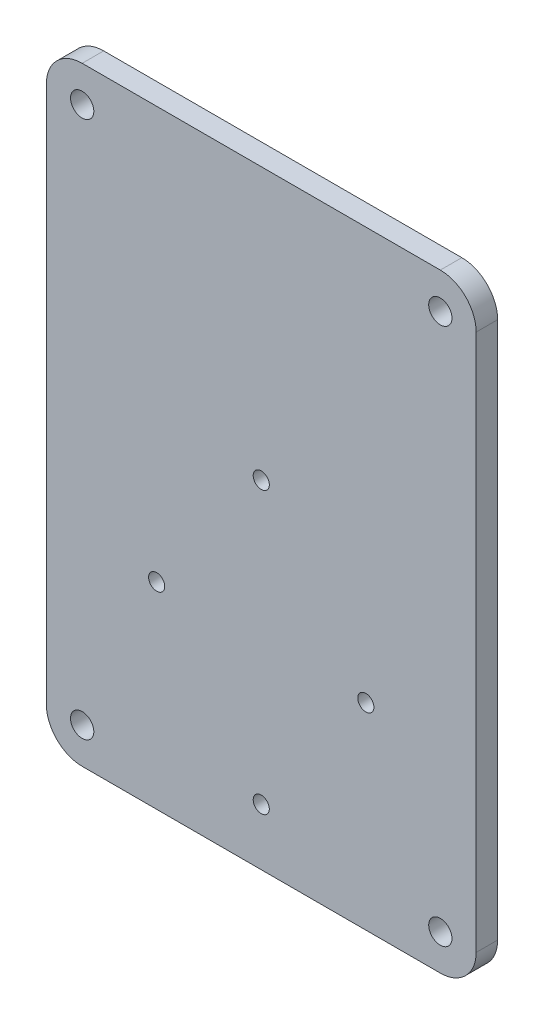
ISO-10303-21;
HEADER;
FILE_DESCRIPTION(('STEP AP214'),'2;1');
FILE_NAME('part.step','',(''),(''),'','','');
FILE_SCHEMA(('AUTOMOTIVE_DESIGN { 1 0 10303 214 1 1 1 1 }'));
ENDSEC;
DATA;
#1=APPLICATION_CONTEXT('core data for automotive mechanical design processes');
#2=APPLICATION_PROTOCOL_DEFINITION('international standard','automotive_design',2000,#1);
#3=PRODUCT_CONTEXT('',#1,'mechanical');
#4=PRODUCT('Part','Part','',(#3));
#5=PRODUCT_RELATED_PRODUCT_CATEGORY('part','',(#4));
#6=PRODUCT_DEFINITION_FORMATION('','',#4);
#7=PRODUCT_DEFINITION_CONTEXT('part definition',#1,'design');
#8=PRODUCT_DEFINITION('design','',#6,#7);
#9=PRODUCT_DEFINITION_SHAPE('','',#8);
#10=(LENGTH_UNIT() NAMED_UNIT(*) SI_UNIT(.MILLI.,.METRE.));
#11=(NAMED_UNIT(*) PLANE_ANGLE_UNIT() SI_UNIT($,.RADIAN.));
#12=(NAMED_UNIT(*) SI_UNIT($,.STERADIAN.) SOLID_ANGLE_UNIT());
#13=UNCERTAINTY_MEASURE_WITH_UNIT(LENGTH_MEASURE(1.E-05),#10,'distance_accuracy_value','');
#14=(GEOMETRIC_REPRESENTATION_CONTEXT(3) GLOBAL_UNCERTAINTY_ASSIGNED_CONTEXT((#13)) GLOBAL_UNIT_ASSIGNED_CONTEXT((#10,
#11,#12)) REPRESENTATION_CONTEXT('',''));
#15=CARTESIAN_POINT('',(0.,0.,0.));
#16=DIRECTION('',(0.,0.,1.));
#17=DIRECTION('',(1.,0.,0.));
#18=AXIS2_PLACEMENT_3D('',#15,#16,#17);
#19=CARTESIAN_POINT('',(60.,85.,6.));
#20=DIRECTION('',(-1.,0.,0.));
#21=DIRECTION('',(0.,-1.,0.));
#22=AXIS2_PLACEMENT_3D('',#19,#20,#21);
#23=PLANE('',#22);
#24=DIRECTION('',(0.,1.,0.));
#25=VECTOR('',#24,1.);
#26=CARTESIAN_POINT('',(60.,85.,6.));
#27=LINE('',#26,#25);
#28=CARTESIAN_POINT('',(60.,-75.,6.));
#29=VERTEX_POINT('',#28);
#30=CARTESIAN_POINT('',(60.,75.,6.));
#31=VERTEX_POINT('',#30);
#32=EDGE_CURVE('E121',#29,#31,#27,.T.);
#33=ORIENTED_EDGE('',*,*,#32,.F.);
#34=DIRECTION('',(0.,0.,-1.));
#35=VECTOR('',#34,1.);
#36=CARTESIAN_POINT('',(60.,-75.,6.));
#37=LINE('',#36,#35);
#38=CARTESIAN_POINT('',(60.,-75.,0.));
#39=VERTEX_POINT('',#38);
#40=EDGE_CURVE('E106',#29,#39,#37,.T.);
#41=ORIENTED_EDGE('',*,*,#40,.T.);
#42=DIRECTION('',(0.,1.,0.));
#43=VECTOR('',#42,1.);
#44=CARTESIAN_POINT('',(60.,85.,0.));
#45=LINE('',#44,#43);
#46=CARTESIAN_POINT('',(60.,75.,0.));
#47=VERTEX_POINT('',#46);
#48=EDGE_CURVE('E118',#39,#47,#45,.T.);
#49=ORIENTED_EDGE('',*,*,#48,.T.);
#50=DIRECTION('',(0.,0.,-1.));
#51=VECTOR('',#50,1.);
#52=CARTESIAN_POINT('',(60.,75.,6.));
#53=LINE('',#52,#51);
#54=EDGE_CURVE('E123',#47,#31,#53,.F.);
#55=ORIENTED_EDGE('',*,*,#54,.T.);
#56=EDGE_LOOP('',(#33,#41,#49,#55));
#57=FACE_BOUND('',#56,.T.);
#58=ADVANCED_FACE('F36',(#57),#23,.F.);
#59=CARTESIAN_POINT('',(-60.,85.,6.));
#60=DIRECTION('',(0.,-1.,0.));
#61=DIRECTION('',(0.,0.,-1.));
#62=AXIS2_PLACEMENT_3D('',#59,#60,#61);
#63=PLANE('',#62);
#64=DIRECTION('',(-1.,0.,0.));
#65=VECTOR('',#64,1.);
#66=CARTESIAN_POINT('',(-60.,85.,0.));
#67=LINE('',#66,#65);
#68=CARTESIAN_POINT('',(50.,85.,0.));
#69=VERTEX_POINT('',#68);
#70=CARTESIAN_POINT('',(-50.,85.,0.));
#71=VERTEX_POINT('',#70);
#72=EDGE_CURVE('E127',#69,#71,#67,.T.);
#73=ORIENTED_EDGE('',*,*,#72,.T.);
#74=DIRECTION('',(0.,0.,-1.));
#75=VECTOR('',#74,1.);
#76=CARTESIAN_POINT('',(-50.,85.,6.));
#77=LINE('',#76,#75);
#78=CARTESIAN_POINT('',(-50.,85.,6.));
#79=VERTEX_POINT('',#78);
#80=EDGE_CURVE('E11',#71,#79,#77,.F.);
#81=ORIENTED_EDGE('',*,*,#80,.T.);
#82=DIRECTION('',(-1.,0.,0.));
#83=VECTOR('',#82,1.);
#84=CARTESIAN_POINT('',(-60.,85.,6.));
#85=LINE('',#84,#83);
#86=CARTESIAN_POINT('',(50.,85.,6.));
#87=VERTEX_POINT('',#86);
#88=EDGE_CURVE('E167',#87,#79,#85,.T.);
#89=ORIENTED_EDGE('',*,*,#88,.F.);
#90=DIRECTION('',(0.,0.,-1.));
#91=VECTOR('',#90,1.);
#92=CARTESIAN_POINT('',(50.,85.,6.));
#93=LINE('',#92,#91);
#94=EDGE_CURVE('E44',#87,#69,#93,.T.);
#95=ORIENTED_EDGE('',*,*,#94,.T.);
#96=EDGE_LOOP('',(#73,#81,#89,#95));
#97=FACE_BOUND('',#96,.T.);
#98=ADVANCED_FACE('F165',(#97),#63,.F.);
#99=CARTESIAN_POINT('',(-60.,85.,6.));
#100=DIRECTION('',(1.,0.,0.));
#101=DIRECTION('',(0.,1.,0.));
#102=AXIS2_PLACEMENT_3D('',#99,#100,#101);
#103=PLANE('',#102);
#104=DIRECTION('',(0.,-1.,0.));
#105=VECTOR('',#104,1.);
#106=CARTESIAN_POINT('',(-60.,85.,0.));
#107=LINE('',#106,#105);
#108=CARTESIAN_POINT('',(-60.,75.,0.));
#109=VERTEX_POINT('',#108);
#110=CARTESIAN_POINT('',(-60.,-75.,0.));
#111=VERTEX_POINT('',#110);
#112=EDGE_CURVE('E131',#109,#111,#107,.T.);
#113=ORIENTED_EDGE('',*,*,#112,.T.);
#114=DIRECTION('',(0.,0.,-1.));
#115=VECTOR('',#114,1.);
#116=CARTESIAN_POINT('',(-60.,-75.,6.));
#117=LINE('',#116,#115);
#118=CARTESIAN_POINT('',(-60.,-75.,6.));
#119=VERTEX_POINT('',#118);
#120=EDGE_CURVE('E51',#111,#119,#117,.F.);
#121=ORIENTED_EDGE('',*,*,#120,.T.);
#122=DIRECTION('',(0.,-1.,0.));
#123=VECTOR('',#122,1.);
#124=CARTESIAN_POINT('',(-60.,85.,6.));
#125=LINE('',#124,#123);
#126=CARTESIAN_POINT('',(-60.,75.,6.));
#127=VERTEX_POINT('',#126);
#128=EDGE_CURVE('E175',#127,#119,#125,.T.);
#129=ORIENTED_EDGE('',*,*,#128,.F.);
#130=DIRECTION('',(0.,0.,-1.));
#131=VECTOR('',#130,1.);
#132=CARTESIAN_POINT('',(-60.,75.,6.));
#133=LINE('',#132,#131);
#134=EDGE_CURVE('E158',#127,#109,#133,.T.);
#135=ORIENTED_EDGE('',*,*,#134,.T.);
#136=EDGE_LOOP('',(#113,#121,#129,#135));
#137=FACE_BOUND('',#136,.T.);
#138=ADVANCED_FACE('F174',(#137),#103,.F.);
#139=CARTESIAN_POINT('',(-60.,-85.,6.));
#140=DIRECTION('',(0.,1.,0.));
#141=DIRECTION('',(0.,0.,1.));
#142=AXIS2_PLACEMENT_3D('',#139,#140,#141);
#143=PLANE('',#142);
#144=DIRECTION('',(1.,0.,0.));
#145=VECTOR('',#144,1.);
#146=CARTESIAN_POINT('',(-60.,-85.,0.));
#147=LINE('',#146,#145);
#148=CARTESIAN_POINT('',(-50.,-85.,0.));
#149=VERTEX_POINT('',#148);
#150=CARTESIAN_POINT('',(50.,-85.,0.));
#151=VERTEX_POINT('',#150);
#152=EDGE_CURVE('E141',#149,#151,#147,.T.);
#153=ORIENTED_EDGE('',*,*,#152,.T.);
#154=DIRECTION('',(0.,0.,-1.));
#155=VECTOR('',#154,1.);
#156=CARTESIAN_POINT('',(50.,-85.,6.));
#157=LINE('',#156,#155);
#158=CARTESIAN_POINT('',(50.,-85.,6.));
#159=VERTEX_POINT('',#158);
#160=EDGE_CURVE('E107',#151,#159,#157,.F.);
#161=ORIENTED_EDGE('',*,*,#160,.T.);
#162=DIRECTION('',(1.,0.,0.));
#163=VECTOR('',#162,1.);
#164=CARTESIAN_POINT('',(-60.,-85.,6.));
#165=LINE('',#164,#163);
#166=CARTESIAN_POINT('',(-50.,-85.,6.));
#167=VERTEX_POINT('',#166);
#168=EDGE_CURVE('E137',#167,#159,#165,.T.);
#169=ORIENTED_EDGE('',*,*,#168,.F.);
#170=DIRECTION('',(0.,0.,-1.));
#171=VECTOR('',#170,1.);
#172=CARTESIAN_POINT('',(-50.,-85.,6.));
#173=LINE('',#172,#171);
#174=EDGE_CURVE('E112',#167,#149,#173,.T.);
#175=ORIENTED_EDGE('',*,*,#174,.T.);
#176=EDGE_LOOP('',(#153,#161,#169,#175));
#177=FACE_BOUND('',#176,.T.);
#178=ADVANCED_FACE('F238',(#177),#143,.F.);
#179=CARTESIAN_POINT('',(0.,0.,6.));
#180=DIRECTION('',(0.,0.,1.));
#181=DIRECTION('',(1.,0.,0.));
#182=AXIS2_PLACEMENT_3D('',#179,#180,#181);
#183=PLANE('',#182);
#184=CARTESIAN_POINT('',(50.,75.,6.));
#185=DIRECTION('',(0.,0.,1.));
#186=DIRECTION('',(1.,0.,0.));
#187=AXIS2_PLACEMENT_3D('',#184,#185,#186);
#188=CIRCLE('',#187,3.25);
#189=CARTESIAN_POINT('',(53.25,75.,6.));
#190=VERTEX_POINT('',#189);
#191=EDGE_CURVE('E220',#190,#190,#188,.T.);
#192=ORIENTED_EDGE('',*,*,#191,.F.);
#193=EDGE_LOOP('',(#192));
#194=FACE_BOUND('',#193,.T.);
#195=CARTESIAN_POINT('',(50.,-75.,6.));
#196=DIRECTION('',(0.,0.,1.));
#197=DIRECTION('',(1.,0.,0.));
#198=AXIS2_PLACEMENT_3D('',#195,#196,#197);
#199=CIRCLE('',#198,3.25);
#200=CARTESIAN_POINT('',(53.25,-75.,6.));
#201=VERTEX_POINT('',#200);
#202=EDGE_CURVE('E214',#201,#201,#199,.T.);
#203=ORIENTED_EDGE('',*,*,#202,.F.);
#204=EDGE_LOOP('',(#203));
#205=FACE_BOUND('',#204,.T.);
#206=CARTESIAN_POINT('',(-50.,-75.,6.));
#207=DIRECTION('',(0.,0.,1.));
#208=DIRECTION('',(1.,0.,0.));
#209=AXIS2_PLACEMENT_3D('',#206,#207,#208);
#210=CIRCLE('',#209,3.25);
#211=CARTESIAN_POINT('',(-46.75,-75.,6.));
#212=VERTEX_POINT('',#211);
#213=EDGE_CURVE('E208',#212,#212,#210,.T.);
#214=ORIENTED_EDGE('',*,*,#213,.F.);
#215=EDGE_LOOP('',(#214));
#216=FACE_BOUND('',#215,.T.);
#217=CARTESIAN_POINT('',(-50.,75.,6.));
#218=DIRECTION('',(0.,0.,1.));
#219=DIRECTION('',(1.,0.,0.));
#220=AXIS2_PLACEMENT_3D('',#217,#218,#219);
#221=CIRCLE('',#220,3.25);
#222=CARTESIAN_POINT('',(-46.75,75.,6.));
#223=VERTEX_POINT('',#222);
#224=EDGE_CURVE('E202',#223,#223,#221,.T.);
#225=ORIENTED_EDGE('',*,*,#224,.F.);
#226=EDGE_LOOP('',(#225));
#227=FACE_BOUND('',#226,.T.);
#228=CARTESIAN_POINT('',(0.,-69.2,6.));
#229=DIRECTION('',(0.,0.,1.));
#230=DIRECTION('',(1.,0.,0.));
#231=AXIS2_PLACEMENT_3D('',#228,#229,#230);
#232=CIRCLE('',#231,2.25);
#233=CARTESIAN_POINT('',(2.25,-69.2,6.));
#234=VERTEX_POINT('',#233);
#235=EDGE_CURVE('E197',#234,#234,#232,.T.);
#236=ORIENTED_EDGE('',*,*,#235,.F.);
#237=EDGE_LOOP('',(#236));
#238=FACE_BOUND('',#237,.T.);
#239=CARTESIAN_POINT('',(29.2,-30.,6.));
#240=DIRECTION('',(0.,0.,1.));
#241=DIRECTION('',(1.,0.,0.));
#242=AXIS2_PLACEMENT_3D('',#239,#240,#241);
#243=CIRCLE('',#242,2.25000000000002);
#244=CARTESIAN_POINT('',(31.45,-30.,6.));
#245=VERTEX_POINT('',#244);
#246=EDGE_CURVE('E191',#245,#245,#243,.T.);
#247=ORIENTED_EDGE('',*,*,#246,.F.);
#248=EDGE_LOOP('',(#247));
#249=FACE_BOUND('',#248,.T.);
#250=CARTESIAN_POINT('',(0.,9.20000000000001,6.));
#251=DIRECTION('',(0.,0.,1.));
#252=DIRECTION('',(1.,0.,0.));
#253=AXIS2_PLACEMENT_3D('',#250,#251,#252);
#254=CIRCLE('',#253,2.25);
#255=CARTESIAN_POINT('',(2.25,9.20000000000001,6.));
#256=VERTEX_POINT('',#255);
#257=EDGE_CURVE('E184',#256,#256,#254,.T.);
#258=ORIENTED_EDGE('',*,*,#257,.F.);
#259=EDGE_LOOP('',(#258));
#260=FACE_BOUND('',#259,.T.);
#261=CARTESIAN_POINT('',(-29.2,-30.,6.));
#262=DIRECTION('',(0.,0.,1.));
#263=DIRECTION('',(1.,0.,0.));
#264=AXIS2_PLACEMENT_3D('',#261,#262,#263);
#265=CIRCLE('',#264,2.25);
#266=CARTESIAN_POINT('',(-26.95,-30.,6.));
#267=VERTEX_POINT('',#266);
#268=EDGE_CURVE('E134',#267,#267,#265,.T.);
#269=ORIENTED_EDGE('',*,*,#268,.F.);
#270=EDGE_LOOP('',(#269));
#271=FACE_BOUND('',#270,.T.);
#272=ORIENTED_EDGE('',*,*,#168,.T.);
#273=CARTESIAN_POINT('',(50.,-75.,6.));
#274=DIRECTION('',(0.,0.,1.));
#275=DIRECTION('',(1.,0.,0.));
#276=AXIS2_PLACEMENT_3D('',#273,#274,#275);
#277=CIRCLE('',#276,10.);
#278=EDGE_CURVE('E156',#159,#29,#277,.T.);
#279=ORIENTED_EDGE('',*,*,#278,.T.);
#280=ORIENTED_EDGE('',*,*,#32,.T.);
#281=CARTESIAN_POINT('',(50.,75.,6.));
#282=DIRECTION('',(0.,0.,1.));
#283=DIRECTION('',(1.,0.,0.));
#284=AXIS2_PLACEMENT_3D('',#281,#282,#283);
#285=CIRCLE('',#284,10.);
#286=EDGE_CURVE('E151',#31,#87,#285,.T.);
#287=ORIENTED_EDGE('',*,*,#286,.T.);
#288=ORIENTED_EDGE('',*,*,#88,.T.);
#289=CARTESIAN_POINT('',(-50.,75.,6.));
#290=DIRECTION('',(0.,0.,1.));
#291=DIRECTION('',(1.,0.,0.));
#292=AXIS2_PLACEMENT_3D('',#289,#290,#291);
#293=CIRCLE('',#292,10.);
#294=EDGE_CURVE('E58',#79,#127,#293,.T.);
#295=ORIENTED_EDGE('',*,*,#294,.T.);
#296=ORIENTED_EDGE('',*,*,#128,.T.);
#297=CARTESIAN_POINT('',(-50.,-75.,6.));
#298=DIRECTION('',(0.,0.,1.));
#299=DIRECTION('',(1.,0.,0.));
#300=AXIS2_PLACEMENT_3D('',#297,#298,#299);
#301=CIRCLE('',#300,10.);
#302=EDGE_CURVE('E154',#119,#167,#301,.T.);
#303=ORIENTED_EDGE('',*,*,#302,.T.);
#304=EDGE_LOOP('',(#272,#279,#280,#287,#288,#295,#296,#303));
#305=FACE_BOUND('',#304,.T.);
#306=ADVANCED_FACE('F235',(#194,#205,#216,#227,#238,#249,#260,#271,#305),#183,.T.);
#307=CARTESIAN_POINT('',(0.,0.,0.));
#308=DIRECTION('',(0.,0.,1.));
#309=DIRECTION('',(1.,0.,0.));
#310=AXIS2_PLACEMENT_3D('',#307,#308,#309);
#311=PLANE('',#310);
#312=CARTESIAN_POINT('',(50.,75.,0.));
#313=DIRECTION('',(0.,0.,1.));
#314=DIRECTION('',(1.,0.,0.));
#315=AXIS2_PLACEMENT_3D('',#312,#313,#314);
#316=CIRCLE('',#315,3.25);
#317=CARTESIAN_POINT('',(53.25,75.,0.));
#318=VERTEX_POINT('',#317);
#319=EDGE_CURVE('E205',#318,#318,#316,.T.);
#320=ORIENTED_EDGE('',*,*,#319,.T.);
#321=EDGE_LOOP('',(#320));
#322=FACE_BOUND('',#321,.T.);
#323=CARTESIAN_POINT('',(50.,-75.,0.));
#324=DIRECTION('',(0.,0.,1.));
#325=DIRECTION('',(1.,0.,0.));
#326=AXIS2_PLACEMENT_3D('',#323,#324,#325);
#327=CIRCLE('',#326,3.25);
#328=CARTESIAN_POINT('',(53.25,-75.,0.));
#329=VERTEX_POINT('',#328);
#330=EDGE_CURVE('E217',#329,#329,#327,.T.);
#331=ORIENTED_EDGE('',*,*,#330,.T.);
#332=EDGE_LOOP('',(#331));
#333=FACE_BOUND('',#332,.T.);
#334=CARTESIAN_POINT('',(-50.,-75.,0.));
#335=DIRECTION('',(0.,0.,1.));
#336=DIRECTION('',(1.,0.,0.));
#337=AXIS2_PLACEMENT_3D('',#334,#335,#336);
#338=CIRCLE('',#337,3.25);
#339=CARTESIAN_POINT('',(-46.75,-75.,0.));
#340=VERTEX_POINT('',#339);
#341=EDGE_CURVE('E211',#340,#340,#338,.T.);
#342=ORIENTED_EDGE('',*,*,#341,.T.);
#343=EDGE_LOOP('',(#342));
#344=FACE_BOUND('',#343,.T.);
#345=CARTESIAN_POINT('',(-50.,75.,0.));
#346=DIRECTION('',(0.,0.,1.));
#347=DIRECTION('',(1.,0.,0.));
#348=AXIS2_PLACEMENT_3D('',#345,#346,#347);
#349=CIRCLE('',#348,3.25);
#350=CARTESIAN_POINT('',(-46.75,75.,0.));
#351=VERTEX_POINT('',#350);
#352=EDGE_CURVE('E188',#351,#351,#349,.T.);
#353=ORIENTED_EDGE('',*,*,#352,.T.);
#354=EDGE_LOOP('',(#353));
#355=FACE_BOUND('',#354,.T.);
#356=CARTESIAN_POINT('',(0.,-69.2,0.));
#357=DIRECTION('',(0.,0.,1.));
#358=DIRECTION('',(1.,0.,0.));
#359=AXIS2_PLACEMENT_3D('',#356,#357,#358);
#360=CIRCLE('',#359,2.25);
#361=CARTESIAN_POINT('',(2.25,-69.2,0.));
#362=VERTEX_POINT('',#361);
#363=EDGE_CURVE('E182',#362,#362,#360,.T.);
#364=ORIENTED_EDGE('',*,*,#363,.T.);
#365=EDGE_LOOP('',(#364));
#366=FACE_BOUND('',#365,.T.);
#367=CARTESIAN_POINT('',(29.2,-30.,0.));
#368=DIRECTION('',(0.,0.,1.));
#369=DIRECTION('',(1.,0.,0.));
#370=AXIS2_PLACEMENT_3D('',#367,#368,#369);
#371=CIRCLE('',#370,2.25000000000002);
#372=CARTESIAN_POINT('',(31.45,-30.,0.));
#373=VERTEX_POINT('',#372);
#374=EDGE_CURVE('E194',#373,#373,#371,.T.);
#375=ORIENTED_EDGE('',*,*,#374,.T.);
#376=EDGE_LOOP('',(#375));
#377=FACE_BOUND('',#376,.T.);
#378=CARTESIAN_POINT('',(0.,9.20000000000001,0.));
#379=DIRECTION('',(0.,0.,1.));
#380=DIRECTION('',(1.,0.,0.));
#381=AXIS2_PLACEMENT_3D('',#378,#379,#380);
#382=CIRCLE('',#381,2.25);
#383=CARTESIAN_POINT('',(2.25,9.20000000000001,0.));
#384=VERTEX_POINT('',#383);
#385=EDGE_CURVE('E187',#384,#384,#382,.T.);
#386=ORIENTED_EDGE('',*,*,#385,.T.);
#387=EDGE_LOOP('',(#386));
#388=FACE_BOUND('',#387,.T.);
#389=CARTESIAN_POINT('',(-29.2,-30.,0.));
#390=DIRECTION('',(0.,0.,1.));
#391=DIRECTION('',(1.,0.,0.));
#392=AXIS2_PLACEMENT_3D('',#389,#390,#391);
#393=CIRCLE('',#392,2.25);
#394=CARTESIAN_POINT('',(-26.95,-30.,0.));
#395=VERTEX_POINT('',#394);
#396=EDGE_CURVE('E128',#395,#395,#393,.T.);
#397=ORIENTED_EDGE('',*,*,#396,.T.);
#398=EDGE_LOOP('',(#397));
#399=FACE_BOUND('',#398,.T.);
#400=ORIENTED_EDGE('',*,*,#48,.F.);
#401=CARTESIAN_POINT('',(50.,-75.,0.));
#402=DIRECTION('',(0.,0.,1.));
#403=DIRECTION('',(1.,0.,0.));
#404=AXIS2_PLACEMENT_3D('',#401,#402,#403);
#405=CIRCLE('',#404,10.);
#406=EDGE_CURVE('E102',#39,#151,#405,.F.);
#407=ORIENTED_EDGE('',*,*,#406,.T.);
#408=ORIENTED_EDGE('',*,*,#152,.F.);
#409=CARTESIAN_POINT('',(-50.,-75.,0.));
#410=DIRECTION('',(0.,0.,1.));
#411=DIRECTION('',(1.,0.,0.));
#412=AXIS2_PLACEMENT_3D('',#409,#410,#411);
#413=CIRCLE('',#412,10.);
#414=EDGE_CURVE('E113',#149,#111,#413,.F.);
#415=ORIENTED_EDGE('',*,*,#414,.T.);
#416=ORIENTED_EDGE('',*,*,#112,.F.);
#417=CARTESIAN_POINT('',(-50.,75.,0.));
#418=DIRECTION('',(0.,0.,1.));
#419=DIRECTION('',(1.,0.,0.));
#420=AXIS2_PLACEMENT_3D('',#417,#418,#419);
#421=CIRCLE('',#420,10.);
#422=EDGE_CURVE('E145',#109,#71,#421,.F.);
#423=ORIENTED_EDGE('',*,*,#422,.T.);
#424=ORIENTED_EDGE('',*,*,#72,.F.);
#425=CARTESIAN_POINT('',(50.,75.,0.));
#426=DIRECTION('',(0.,0.,1.));
#427=DIRECTION('',(1.,0.,0.));
#428=AXIS2_PLACEMENT_3D('',#425,#426,#427);
#429=CIRCLE('',#428,10.);
#430=EDGE_CURVE('E122',#69,#47,#429,.F.);
#431=ORIENTED_EDGE('',*,*,#430,.T.);
#432=EDGE_LOOP('',(#400,#407,#408,#415,#416,#423,#424,#431));
#433=FACE_BOUND('',#432,.T.);
#434=ADVANCED_FACE('F125',(#322,#333,#344,#355,#366,#377,#388,#399,#433),#311,.F.);
#435=CARTESIAN_POINT('',(-29.2,-30.,0.));
#436=DIRECTION('',(0.,0.,1.));
#437=DIRECTION('',(1.,0.,0.));
#438=AXIS2_PLACEMENT_3D('',#435,#436,#437);
#439=CYLINDRICAL_SURFACE('',#438,2.25);
#440=ORIENTED_EDGE('',*,*,#396,.F.);
#441=EDGE_LOOP('',(#440));
#442=FACE_BOUND('',#441,.T.);
#443=ORIENTED_EDGE('',*,*,#268,.T.);
#444=EDGE_LOOP('',(#443));
#445=FACE_BOUND('',#444,.T.);
#446=ADVANCED_FACE('F278',(#442,#445),#439,.F.);
#447=CARTESIAN_POINT('',(0.,9.20000000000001,0.));
#448=DIRECTION('',(0.,0.,1.));
#449=DIRECTION('',(1.,0.,0.));
#450=AXIS2_PLACEMENT_3D('',#447,#448,#449);
#451=CYLINDRICAL_SURFACE('',#450,2.25);
#452=ORIENTED_EDGE('',*,*,#385,.F.);
#453=EDGE_LOOP('',(#452));
#454=FACE_BOUND('',#453,.T.);
#455=ORIENTED_EDGE('',*,*,#257,.T.);
#456=EDGE_LOOP('',(#455));
#457=FACE_BOUND('',#456,.T.);
#458=ADVANCED_FACE('F282',(#454,#457),#451,.F.);
#459=CARTESIAN_POINT('',(29.2,-30.,0.));
#460=DIRECTION('',(0.,0.,1.));
#461=DIRECTION('',(1.,0.,0.));
#462=AXIS2_PLACEMENT_3D('',#459,#460,#461);
#463=CYLINDRICAL_SURFACE('',#462,2.25000000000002);
#464=ORIENTED_EDGE('',*,*,#374,.F.);
#465=EDGE_LOOP('',(#464));
#466=FACE_BOUND('',#465,.T.);
#467=ORIENTED_EDGE('',*,*,#246,.T.);
#468=EDGE_LOOP('',(#467));
#469=FACE_BOUND('',#468,.T.);
#470=ADVANCED_FACE('F286',(#466,#469),#463,.F.);
#471=CARTESIAN_POINT('',(0.,-69.2,0.));
#472=DIRECTION('',(0.,0.,1.));
#473=DIRECTION('',(1.,0.,0.));
#474=AXIS2_PLACEMENT_3D('',#471,#472,#473);
#475=CYLINDRICAL_SURFACE('',#474,2.25);
#476=ORIENTED_EDGE('',*,*,#363,.F.);
#477=EDGE_LOOP('',(#476));
#478=FACE_BOUND('',#477,.T.);
#479=ORIENTED_EDGE('',*,*,#235,.T.);
#480=EDGE_LOOP('',(#479));
#481=FACE_BOUND('',#480,.T.);
#482=ADVANCED_FACE('F264',(#478,#481),#475,.F.);
#483=CARTESIAN_POINT('',(50.,-75.,6.));
#484=DIRECTION('',(0.,0.,-1.));
#485=DIRECTION('',(-1.,0.,0.));
#486=AXIS2_PLACEMENT_3D('',#483,#484,#485);
#487=CYLINDRICAL_SURFACE('',#486,10.);
#488=ORIENTED_EDGE('',*,*,#278,.F.);
#489=ORIENTED_EDGE('',*,*,#160,.F.);
#490=ORIENTED_EDGE('',*,*,#406,.F.);
#491=ORIENTED_EDGE('',*,*,#40,.F.);
#492=EDGE_LOOP('',(#488,#489,#490,#491));
#493=FACE_BOUND('',#492,.T.);
#494=ADVANCED_FACE('F105',(#493),#487,.T.);
#495=CARTESIAN_POINT('',(-50.,-75.,6.));
#496=DIRECTION('',(0.,0.,-1.));
#497=DIRECTION('',(-1.,0.,0.));
#498=AXIS2_PLACEMENT_3D('',#495,#496,#497);
#499=CYLINDRICAL_SURFACE('',#498,10.);
#500=ORIENTED_EDGE('',*,*,#302,.F.);
#501=ORIENTED_EDGE('',*,*,#120,.F.);
#502=ORIENTED_EDGE('',*,*,#414,.F.);
#503=ORIENTED_EDGE('',*,*,#174,.F.);
#504=EDGE_LOOP('',(#500,#501,#502,#503));
#505=FACE_BOUND('',#504,.T.);
#506=ADVANCED_FACE('F257',(#505),#499,.T.);
#507=CARTESIAN_POINT('',(-50.,75.,6.));
#508=DIRECTION('',(0.,0.,-1.));
#509=DIRECTION('',(-1.,0.,0.));
#510=AXIS2_PLACEMENT_3D('',#507,#508,#509);
#511=CYLINDRICAL_SURFACE('',#510,10.);
#512=ORIENTED_EDGE('',*,*,#294,.F.);
#513=ORIENTED_EDGE('',*,*,#80,.F.);
#514=ORIENTED_EDGE('',*,*,#422,.F.);
#515=ORIENTED_EDGE('',*,*,#134,.F.);
#516=EDGE_LOOP('',(#512,#513,#514,#515));
#517=FACE_BOUND('',#516,.T.);
#518=ADVANCED_FACE('F173',(#517),#511,.T.);
#519=CARTESIAN_POINT('',(50.,75.,6.));
#520=DIRECTION('',(0.,0.,-1.));
#521=DIRECTION('',(-1.,0.,0.));
#522=AXIS2_PLACEMENT_3D('',#519,#520,#521);
#523=CYLINDRICAL_SURFACE('',#522,10.);
#524=ORIENTED_EDGE('',*,*,#286,.F.);
#525=ORIENTED_EDGE('',*,*,#54,.F.);
#526=ORIENTED_EDGE('',*,*,#430,.F.);
#527=ORIENTED_EDGE('',*,*,#94,.F.);
#528=EDGE_LOOP('',(#524,#525,#526,#527));
#529=FACE_BOUND('',#528,.T.);
#530=ADVANCED_FACE('F38',(#529),#523,.T.);
#531=CARTESIAN_POINT('',(-50.,75.,0.));
#532=DIRECTION('',(0.,0.,1.));
#533=DIRECTION('',(1.,0.,0.));
#534=AXIS2_PLACEMENT_3D('',#531,#532,#533);
#535=CYLINDRICAL_SURFACE('',#534,3.25);
#536=ORIENTED_EDGE('',*,*,#352,.F.);
#537=EDGE_LOOP('',(#536));
#538=FACE_BOUND('',#537,.T.);
#539=ORIENTED_EDGE('',*,*,#224,.T.);
#540=EDGE_LOOP('',(#539));
#541=FACE_BOUND('',#540,.T.);
#542=ADVANCED_FACE('F294',(#538,#541),#535,.F.);
#543=CARTESIAN_POINT('',(-50.,-75.,0.));
#544=DIRECTION('',(0.,0.,1.));
#545=DIRECTION('',(1.,0.,0.));
#546=AXIS2_PLACEMENT_3D('',#543,#544,#545);
#547=CYLINDRICAL_SURFACE('',#546,3.25);
#548=ORIENTED_EDGE('',*,*,#341,.F.);
#549=EDGE_LOOP('',(#548));
#550=FACE_BOUND('',#549,.T.);
#551=ORIENTED_EDGE('',*,*,#213,.T.);
#552=EDGE_LOOP('',(#551));
#553=FACE_BOUND('',#552,.T.);
#554=ADVANCED_FACE('F297',(#550,#553),#547,.F.);
#555=CARTESIAN_POINT('',(50.,-75.,0.));
#556=DIRECTION('',(0.,0.,1.));
#557=DIRECTION('',(1.,0.,0.));
#558=AXIS2_PLACEMENT_3D('',#555,#556,#557);
#559=CYLINDRICAL_SURFACE('',#558,3.25);
#560=ORIENTED_EDGE('',*,*,#330,.F.);
#561=EDGE_LOOP('',(#560));
#562=FACE_BOUND('',#561,.T.);
#563=ORIENTED_EDGE('',*,*,#202,.T.);
#564=EDGE_LOOP('',(#563));
#565=FACE_BOUND('',#564,.T.);
#566=ADVANCED_FACE('F231',(#562,#565),#559,.F.);
#567=CARTESIAN_POINT('',(50.,75.,0.));
#568=DIRECTION('',(0.,0.,1.));
#569=DIRECTION('',(1.,0.,0.));
#570=AXIS2_PLACEMENT_3D('',#567,#568,#569);
#571=CYLINDRICAL_SURFACE('',#570,3.25);
#572=ORIENTED_EDGE('',*,*,#319,.F.);
#573=EDGE_LOOP('',(#572));
#574=FACE_BOUND('',#573,.T.);
#575=ORIENTED_EDGE('',*,*,#191,.T.);
#576=EDGE_LOOP('',(#575));
#577=FACE_BOUND('',#576,.T.);
#578=ADVANCED_FACE('F228',(#574,#577),#571,.F.);
#579=CLOSED_SHELL('',(#58,#98,#138,#178,#306,#434,#446,#458,#470,#482,#494,#506,#518,#530,#542,
#554,#566,#578));
#580=MANIFOLD_SOLID_BREP('B2',#579);
#581=ADVANCED_BREP_SHAPE_REPRESENTATION('',(#18,#580),#14);
#582=SHAPE_DEFINITION_REPRESENTATION(#9,#581);
ENDSEC;
END-ISO-10303-21;
